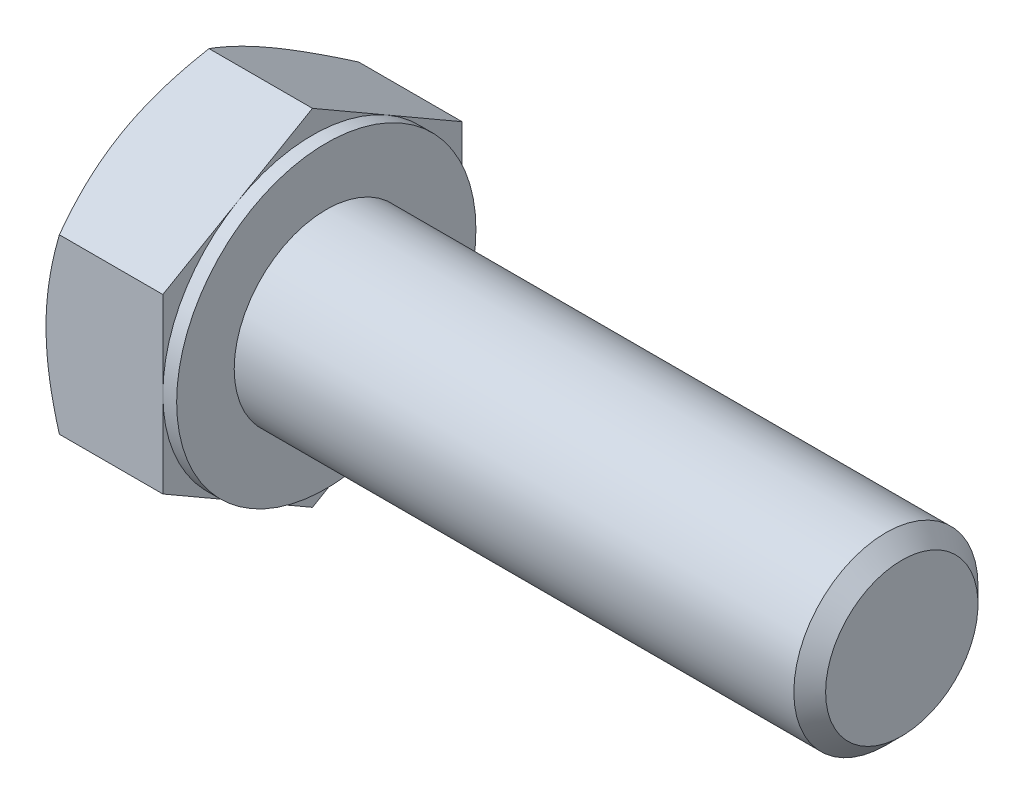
ISO-10303-21;
HEADER;
FILE_DESCRIPTION(('STEP AP214'),'2;1');
FILE_NAME('part.step','',(''),(''),'','','');
FILE_SCHEMA(('AUTOMOTIVE_DESIGN { 1 0 10303 214 1 1 1 1 }'));
ENDSEC;
DATA;
#1=APPLICATION_CONTEXT('core data for automotive mechanical design processes');
#2=APPLICATION_PROTOCOL_DEFINITION('international standard','automotive_design',2000,#1);
#3=PRODUCT_CONTEXT('',#1,'mechanical');
#4=PRODUCT('Part','Part','',(#3));
#5=PRODUCT_RELATED_PRODUCT_CATEGORY('part','',(#4));
#6=PRODUCT_DEFINITION_FORMATION('','',#4);
#7=PRODUCT_DEFINITION_CONTEXT('part definition',#1,'design');
#8=PRODUCT_DEFINITION('design','',#6,#7);
#9=PRODUCT_DEFINITION_SHAPE('','',#8);
#10=(LENGTH_UNIT() NAMED_UNIT(*) SI_UNIT(.MILLI.,.METRE.));
#11=(NAMED_UNIT(*) PLANE_ANGLE_UNIT() SI_UNIT($,.RADIAN.));
#12=(NAMED_UNIT(*) SI_UNIT($,.STERADIAN.) SOLID_ANGLE_UNIT());
#13=UNCERTAINTY_MEASURE_WITH_UNIT(LENGTH_MEASURE(1.E-05),#10,'distance_accuracy_value','');
#14=(GEOMETRIC_REPRESENTATION_CONTEXT(3) GLOBAL_UNCERTAINTY_ASSIGNED_CONTEXT((#13)) GLOBAL_UNIT_ASSIGNED_CONTEXT((#10,
#11,#12)) REPRESENTATION_CONTEXT('',''));
#15=CARTESIAN_POINT('',(0.,0.,0.));
#16=DIRECTION('',(0.,0.,1.));
#17=DIRECTION('',(1.,0.,0.));
#18=AXIS2_PLACEMENT_3D('',#15,#16,#17);
#19=CARTESIAN_POINT('',(5.675,7.50555349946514,0.));
#20=DIRECTION('',(1.,0.,0.));
#21=DIRECTION('',(0.,0.,-1.));
#22=AXIS2_PLACEMENT_3D('',#19,#20,#21);
#23=PLANE('',#22);
#24=CARTESIAN_POINT('',(5.675,0.,0.));
#25=DIRECTION('',(1.,0.,0.));
#26=DIRECTION('',(0.,0.,-1.));
#27=AXIS2_PLACEMENT_3D('',#24,#25,#26);
#28=CIRCLE('',#27,4.);
#29=CARTESIAN_POINT('',(5.675,0.,-4.));
#30=VERTEX_POINT('',#29);
#31=EDGE_CURVE('E270',#30,#30,#28,.F.);
#32=ORIENTED_EDGE('',*,*,#31,.T.);
#33=EDGE_LOOP('',(#32));
#34=FACE_BOUND('',#33,.T.);
#35=CARTESIAN_POINT('',(5.675,0.,0.));
#36=DIRECTION('',(1.,0.,0.));
#37=DIRECTION('',(0.,0.,-1.));
#38=AXIS2_PLACEMENT_3D('',#35,#36,#37);
#39=CIRCLE('',#38,6.5);
#40=CARTESIAN_POINT('',(5.675,0.,-6.5));
#41=VERTEX_POINT('',#40);
#42=EDGE_CURVE('E289',#41,#41,#39,.T.);
#43=ORIENTED_EDGE('',*,*,#42,.T.);
#44=EDGE_LOOP('',(#43));
#45=FACE_BOUND('',#44,.T.);
#46=ADVANCED_FACE('F32',(#34,#45),#23,.T.);
#47=CARTESIAN_POINT('',(0.,0.,0.));
#48=DIRECTION('',(-1.,0.,0.));
#49=DIRECTION('',(0.,0.,1.));
#50=AXIS2_PLACEMENT_3D('',#47,#48,#49);
#51=CYLINDRICAL_SURFACE('',#50,4.);
#52=ORIENTED_EDGE('',*,*,#31,.F.);
#53=EDGE_LOOP('',(#52));
#54=FACE_BOUND('',#53,.T.);
#55=CARTESIAN_POINT('',(29.9845,0.,0.));
#56=DIRECTION('',(-1.,0.,0.));
#57=DIRECTION('',(0.,0.,1.));
#58=AXIS2_PLACEMENT_3D('',#55,#56,#57);
#59=CIRCLE('',#58,4.);
#60=CARTESIAN_POINT('',(29.9845,0.,4.));
#61=VERTEX_POINT('',#60);
#62=EDGE_CURVE('E267',#61,#61,#59,.T.);
#63=ORIENTED_EDGE('',*,*,#62,.T.);
#64=EDGE_LOOP('',(#63));
#65=FACE_BOUND('',#64,.T.);
#66=ADVANCED_FACE('F241',(#54,#65),#51,.T.);
#67=CARTESIAN_POINT('',(30.675,0.,0.));
#68=DIRECTION('',(-1.,0.,0.));
#69=DIRECTION('',(0.,0.,1.));
#70=AXIS2_PLACEMENT_3D('',#67,#68,#69);
#71=CONICAL_SURFACE('',#70,3.3095,0.785398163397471);
#72=ORIENTED_EDGE('',*,*,#62,.F.);
#73=EDGE_LOOP('',(#72));
#74=FACE_BOUND('',#73,.T.);
#75=CARTESIAN_POINT('',(30.675,0.,0.));
#76=DIRECTION('',(-1.,0.,0.));
#77=DIRECTION('',(0.,0.,1.));
#78=AXIS2_PLACEMENT_3D('',#75,#76,#77);
#79=CIRCLE('',#78,3.3095);
#80=CARTESIAN_POINT('',(30.675,0.,3.3095));
#81=VERTEX_POINT('',#80);
#82=EDGE_CURVE('E265',#81,#81,#79,.T.);
#83=ORIENTED_EDGE('',*,*,#82,.T.);
#84=EDGE_LOOP('',(#83));
#85=FACE_BOUND('',#84,.T.);
#86=ADVANCED_FACE('F246',(#74,#85),#71,.T.);
#87=CARTESIAN_POINT('',(30.675,0.,0.));
#88=DIRECTION('',(-1.,0.,0.));
#89=DIRECTION('',(0.,0.,1.));
#90=AXIS2_PLACEMENT_3D('',#87,#88,#89);
#91=PLANE('',#90);
#92=ORIENTED_EDGE('',*,*,#82,.F.);
#93=EDGE_LOOP('',(#92));
#94=FACE_BOUND('',#93,.T.);
#95=ADVANCED_FACE('F253',(#94),#91,.F.);
#96=CARTESIAN_POINT('',(5.075,6.5,0.));
#97=DIRECTION('',(1.,0.,0.));
#98=DIRECTION('',(0.,0.,-1.));
#99=AXIS2_PLACEMENT_3D('',#96,#97,#98);
#100=PLANE('',#99);
#101=DIRECTION('',(0.,0.500000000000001,0.866025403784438));
#102=VECTOR('',#101,1.);
#103=CARTESIAN_POINT('',(5.075,3.75277674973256,-6.5));
#104=LINE('',#103,#102);
#105=CARTESIAN_POINT('',(5.075,3.75277674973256,-6.5));
#106=VERTEX_POINT('',#105);
#107=CARTESIAN_POINT('',(5.075,5.62916512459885,-3.25000000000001));
#108=VERTEX_POINT('',#107);
#109=EDGE_CURVE('E165',#106,#108,#104,.T.);
#110=ORIENTED_EDGE('',*,*,#109,.T.);
#111=CARTESIAN_POINT('',(5.075,0.,0.));
#112=DIRECTION('',(-1.,0.,0.));
#113=DIRECTION('',(0.,0.,1.));
#114=AXIS2_PLACEMENT_3D('',#111,#112,#113);
#115=CIRCLE('',#114,6.5);
#116=CARTESIAN_POINT('',(5.075,0.,-6.5));
#117=VERTEX_POINT('',#116);
#118=EDGE_CURVE('E48',#108,#117,#115,.T.);
#119=ORIENTED_EDGE('',*,*,#118,.T.);
#120=DIRECTION('',(0.,1.,0.));
#121=VECTOR('',#120,1.);
#122=CARTESIAN_POINT('',(5.075,3.75277674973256,-6.5));
#123=LINE('',#122,#121);
#124=EDGE_CURVE('E37',#117,#106,#123,.T.);
#125=ORIENTED_EDGE('',*,*,#124,.T.);
#126=EDGE_LOOP('',(#110,#119,#125));
#127=FACE_BOUND('',#126,.T.);
#128=ADVANCED_FACE('F256',(#127),#100,.T.);
#129=CARTESIAN_POINT('',(5.075,7.50555349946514,0.));
#130=VERTEX_POINT('',#129);
#131=EDGE_CURVE('E163',#108,#130,#104,.T.);
#132=ORIENTED_EDGE('',*,*,#131,.T.);
#133=DIRECTION('',(0.,-0.500000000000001,0.866025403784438));
#134=VECTOR('',#133,1.);
#135=CARTESIAN_POINT('',(5.075,7.50555349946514,0.));
#136=LINE('',#135,#134);
#137=CARTESIAN_POINT('',(5.075,5.62916512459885,3.25));
#138=VERTEX_POINT('',#137);
#139=EDGE_CURVE('E162',#130,#138,#136,.T.);
#140=ORIENTED_EDGE('',*,*,#139,.T.);
#141=EDGE_CURVE('E151',#138,#108,#115,.T.);
#142=ORIENTED_EDGE('',*,*,#141,.T.);
#143=EDGE_LOOP('',(#132,#140,#142));
#144=FACE_BOUND('',#143,.T.);
#145=ADVANCED_FACE('F261',(#144),#100,.T.);
#146=CARTESIAN_POINT('',(5.075,3.75277674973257,6.5));
#147=VERTEX_POINT('',#146);
#148=EDGE_CURVE('E130',#138,#147,#136,.T.);
#149=ORIENTED_EDGE('',*,*,#148,.T.);
#150=DIRECTION('',(0.,-1.,0.));
#151=VECTOR('',#150,1.);
#152=CARTESIAN_POINT('',(5.075,3.75277674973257,6.5));
#153=LINE('',#152,#151);
#154=CARTESIAN_POINT('',(5.075,0.,6.5));
#155=VERTEX_POINT('',#154);
#156=EDGE_CURVE('E124',#147,#155,#153,.T.);
#157=ORIENTED_EDGE('',*,*,#156,.T.);
#158=EDGE_CURVE('E128',#155,#138,#115,.T.);
#159=ORIENTED_EDGE('',*,*,#158,.T.);
#160=EDGE_LOOP('',(#149,#157,#159));
#161=FACE_BOUND('',#160,.T.);
#162=ADVANCED_FACE('F126',(#161),#100,.T.);
#163=CARTESIAN_POINT('',(5.075,-3.75277674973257,6.5));
#164=VERTEX_POINT('',#163);
#165=EDGE_CURVE('E134',#155,#164,#153,.T.);
#166=ORIENTED_EDGE('',*,*,#165,.T.);
#167=DIRECTION('',(0.,-0.500000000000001,-0.866025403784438));
#168=VECTOR('',#167,1.);
#169=CARTESIAN_POINT('',(5.075,-7.50555349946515,0.));
#170=LINE('',#169,#168);
#171=CARTESIAN_POINT('',(5.075,-5.62916512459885,3.25000000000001));
#172=VERTEX_POINT('',#171);
#173=EDGE_CURVE('E141',#164,#172,#170,.T.);
#174=ORIENTED_EDGE('',*,*,#173,.T.);
#175=EDGE_CURVE('E138',#172,#155,#115,.T.);
#176=ORIENTED_EDGE('',*,*,#175,.T.);
#177=EDGE_LOOP('',(#166,#174,#176));
#178=FACE_BOUND('',#177,.T.);
#179=ADVANCED_FACE('F139',(#178),#100,.T.);
#180=CARTESIAN_POINT('',(5.075,-7.50555349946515,0.));
#181=VERTEX_POINT('',#180);
#182=EDGE_CURVE('E157',#172,#181,#170,.T.);
#183=ORIENTED_EDGE('',*,*,#182,.T.);
#184=DIRECTION('',(0.,0.5,-0.866025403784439));
#185=VECTOR('',#184,1.);
#186=CARTESIAN_POINT('',(5.075,-3.75277674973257,-6.5));
#187=LINE('',#186,#185);
#188=CARTESIAN_POINT('',(5.075,-5.62916512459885,-3.25));
#189=VERTEX_POINT('',#188);
#190=EDGE_CURVE('E325',#181,#189,#187,.T.);
#191=ORIENTED_EDGE('',*,*,#190,.T.);
#192=EDGE_CURVE('E145',#189,#172,#115,.T.);
#193=ORIENTED_EDGE('',*,*,#192,.T.);
#194=EDGE_LOOP('',(#183,#191,#193));
#195=FACE_BOUND('',#194,.T.);
#196=ADVANCED_FACE('F330',(#195),#100,.T.);
#197=CARTESIAN_POINT('',(5.075,-3.75277674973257,-6.5));
#198=VERTEX_POINT('',#197);
#199=EDGE_CURVE('E152',#189,#198,#187,.T.);
#200=ORIENTED_EDGE('',*,*,#199,.T.);
#201=EDGE_CURVE('E11',#198,#117,#123,.T.);
#202=ORIENTED_EDGE('',*,*,#201,.T.);
#203=EDGE_CURVE('E343',#117,#189,#115,.T.);
#204=ORIENTED_EDGE('',*,*,#203,.T.);
#205=EDGE_LOOP('',(#200,#202,#204));
#206=FACE_BOUND('',#205,.T.);
#207=ADVANCED_FACE('F262',(#206),#100,.T.);
#208=CARTESIAN_POINT('',(0.,0.,0.));
#209=DIRECTION('',(-1.,0.,0.));
#210=DIRECTION('',(0.,0.,1.));
#211=AXIS2_PLACEMENT_3D('',#208,#209,#210);
#212=CYLINDRICAL_SURFACE('',#211,6.5);
#213=ORIENTED_EDGE('',*,*,#118,.F.);
#214=ORIENTED_EDGE('',*,*,#141,.F.);
#215=ORIENTED_EDGE('',*,*,#158,.F.);
#216=ORIENTED_EDGE('',*,*,#175,.F.);
#217=ORIENTED_EDGE('',*,*,#192,.F.);
#218=ORIENTED_EDGE('',*,*,#203,.F.);
#219=EDGE_LOOP('',(#213,#214,#215,#216,#217,#218));
#220=FACE_BOUND('',#219,.T.);
#221=ORIENTED_EDGE('',*,*,#42,.F.);
#222=EDGE_LOOP('',(#221));
#223=FACE_BOUND('',#222,.T.);
#224=ADVANCED_FACE('F148',(#220,#223),#212,.T.);
#225=CARTESIAN_POINT('',(0.,7.50555349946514,0.));
#226=DIRECTION('',(1.,0.,0.));
#227=DIRECTION('',(0.,0.,-1.));
#228=AXIS2_PLACEMENT_3D('',#225,#226,#227);
#229=PLANE('',#228);
#230=CARTESIAN_POINT('',(0.,0.,0.));
#231=DIRECTION('',(1.,0.,0.));
#232=DIRECTION('',(0.,0.,-1.));
#233=AXIS2_PLACEMENT_3D('',#230,#231,#232);
#234=CIRCLE('',#233,6.5);
#235=CARTESIAN_POINT('',(0.,0.,-6.5));
#236=VERTEX_POINT('',#235);
#237=CARTESIAN_POINT('',(0.,5.62916512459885,-3.25000000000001));
#238=VERTEX_POINT('',#237);
#239=EDGE_CURVE('E288',#236,#238,#234,.T.);
#240=ORIENTED_EDGE('',*,*,#239,.F.);
#241=CARTESIAN_POINT('',(0.,-5.62916512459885,-3.25));
#242=VERTEX_POINT('',#241);
#243=EDGE_CURVE('E285',#242,#236,#234,.T.);
#244=ORIENTED_EDGE('',*,*,#243,.F.);
#245=CARTESIAN_POINT('',(0.,-5.62916512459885,3.25000000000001));
#246=VERTEX_POINT('',#245);
#247=EDGE_CURVE('E287',#246,#242,#234,.T.);
#248=ORIENTED_EDGE('',*,*,#247,.F.);
#249=CARTESIAN_POINT('',(0.,0.,6.5));
#250=VERTEX_POINT('',#249);
#251=EDGE_CURVE('E297',#250,#246,#234,.T.);
#252=ORIENTED_EDGE('',*,*,#251,.F.);
#253=CARTESIAN_POINT('',(0.,0.,0.));
#254=DIRECTION('',(-1.,0.,0.));
#255=DIRECTION('',(0.,0.,1.));
#256=AXIS2_PLACEMENT_3D('',#253,#254,#255);
#257=CIRCLE('',#256,6.5);
#258=CARTESIAN_POINT('',(0.,5.62916512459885,3.25));
#259=VERTEX_POINT('',#258);
#260=EDGE_CURVE('E166',#250,#259,#257,.T.);
#261=ORIENTED_EDGE('',*,*,#260,.T.);
#262=EDGE_CURVE('E292',#238,#259,#234,.T.);
#263=ORIENTED_EDGE('',*,*,#262,.F.);
#264=EDGE_LOOP('',(#240,#244,#248,#252,#261,#263));
#265=FACE_BOUND('',#264,.T.);
#266=ADVANCED_FACE('F195',(#265),#229,.F.);
#267=CARTESIAN_POINT('',(0.,0.,0.));
#268=DIRECTION('',(1.,0.,0.));
#269=DIRECTION('',(0.,0.,-1.));
#270=AXIS2_PLACEMENT_3D('',#267,#268,#269);
#271=CONICAL_SURFACE('',#270,6.5,1.0471975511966);
#272=CARTESIAN_POINT('',(0.580623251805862,3.75266127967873,6.5002));
#273=CARTESIAN_POINT('',(0.53300442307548,3.8351516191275,6.35732254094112));
#274=CARTESIAN_POINT('',(0.487546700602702,3.91794952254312,6.21391236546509));
#275=CARTESIAN_POINT('',(0.401548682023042,4.08421773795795,5.9259273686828));
#276=CARTESIAN_POINT('',(0.361010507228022,4.16768832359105,5.78135207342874));
#277=CARTESIAN_POINT('',(0.247571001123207,4.41943655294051,5.34531134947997));
#278=CARTESIAN_POINT('',(0.183047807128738,4.58870793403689,5.05212471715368));
#279=CARTESIAN_POINT('',(0.107386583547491,4.84201947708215,4.61337625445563));
#280=CARTESIAN_POINT('',(0.0858328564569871,4.92530276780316,4.46912536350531));
#281=CARTESIAN_POINT('',(0.0496903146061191,5.09224566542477,4.17997178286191));
#282=CARTESIAN_POINT('',(0.0351008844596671,5.17590523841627,4.03506915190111));
#283=CARTESIAN_POINT('',(0.0132587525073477,5.34336968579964,3.74501222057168));
#284=CARTESIAN_POINT('',(0.00599772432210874,5.427174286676,3.59985839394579));
#285=CARTESIAN_POINT('',(-0.00103969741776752,5.59485627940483,3.30942466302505));
#286=CARTESIAN_POINT('',(-0.000816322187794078,5.6787336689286,3.16414476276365));
#287=CARTESIAN_POINT('',(0.0100834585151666,5.90853103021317,2.76612405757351));
#288=CARTESIAN_POINT('',(0.0283818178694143,6.05437578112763,2.51351353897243));
#289=CARTESIAN_POINT('',(0.0864063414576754,6.34509659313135,2.00997032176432));
#290=CARTESIAN_POINT('',(0.126152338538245,6.48997163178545,1.75903939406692));
#291=CARTESIAN_POINT('',(0.225505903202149,6.78127752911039,1.25448277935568));
#292=CARTESIAN_POINT('',(0.285534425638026,6.92767163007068,1.00092075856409));
#293=CARTESIAN_POINT('',(0.421774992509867,7.21827667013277,0.497578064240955));
#294=CARTESIAN_POINT('',(0.497955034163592,7.36249133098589,0.247790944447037));
#295=CARTESIAN_POINT('',(0.580623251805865,7.50566896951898,-0.000200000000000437));
#296=B_SPLINE_CURVE_WITH_KNOTS('',3,(#272,#273,#274,#275,#276,#277,#278,#279,#280,#281,#282,
#283,#284,#285,#286,#287,#288,#289,#290,#291,#292,#293,#294,#295),.UNSPECIFIED.,.F.,.F.,(4,2,2,
2,2,2,2,2,2,2,2,4),(0.,0.515105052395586,1.03043143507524,2.06322554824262,2.56697389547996,
3.07067772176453,3.57380860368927,4.07692394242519,4.9527935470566,5.82947446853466,
6.72559912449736,7.61996451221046),.UNSPECIFIED.);
#297=CARTESIAN_POINT('',(0.580556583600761,7.50555349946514,0.));
#298=VERTEX_POINT('',#297);
#299=EDGE_CURVE('E213',#259,#298,#296,.T.);
#300=ORIENTED_EDGE('',*,*,#299,.T.);
#301=CARTESIAN_POINT('',(0.580623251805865,7.50566896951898,0.0002));
#302=CARTESIAN_POINT('',(0.533004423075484,7.4231786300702,-0.14267745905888));
#303=CARTESIAN_POINT('',(0.487546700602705,7.34038072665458,-0.286087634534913));
#304=CARTESIAN_POINT('',(0.401548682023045,7.17411251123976,-0.574072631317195));
#305=CARTESIAN_POINT('',(0.361010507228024,7.09064192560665,-0.718647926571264));
#306=CARTESIAN_POINT('',(0.247571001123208,6.83889369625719,-1.15468865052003));
#307=CARTESIAN_POINT('',(0.18304780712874,6.66962231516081,-1.44787528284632));
#308=CARTESIAN_POINT('',(0.107386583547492,6.41631077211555,-1.88662374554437));
#309=CARTESIAN_POINT('',(0.0858328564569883,6.33302748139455,-2.03087463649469));
#310=CARTESIAN_POINT('',(0.0496903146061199,6.16608458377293,-2.32002821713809));
#311=CARTESIAN_POINT('',(0.0351008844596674,6.08242501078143,-2.46493084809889));
#312=CARTESIAN_POINT('',(0.0132587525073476,5.91496056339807,-2.75498777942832));
#313=CARTESIAN_POINT('',(0.00599772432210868,5.83115596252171,-2.90014160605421));
#314=CARTESIAN_POINT('',(-0.00103969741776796,5.66347396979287,-3.19057533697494));
#315=CARTESIAN_POINT('',(-0.000816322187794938,5.5795965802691,-3.33585523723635));
#316=CARTESIAN_POINT('',(0.010083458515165,5.34979921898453,-3.73387594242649));
#317=CARTESIAN_POINT('',(0.0283818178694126,5.20395446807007,-3.98648646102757));
#318=CARTESIAN_POINT('',(0.0864063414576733,4.91323365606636,-4.49002967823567));
#319=CARTESIAN_POINT('',(0.126152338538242,4.76835861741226,-4.74096060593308));
#320=CARTESIAN_POINT('',(0.225505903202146,4.47705272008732,-5.24551722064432));
#321=CARTESIAN_POINT('',(0.285534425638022,4.33065861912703,-5.49907924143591));
#322=CARTESIAN_POINT('',(0.421774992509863,4.04005357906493,-6.00242193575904));
#323=CARTESIAN_POINT('',(0.497955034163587,3.89583891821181,-6.25220905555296));
#324=CARTESIAN_POINT('',(0.580623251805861,3.75266127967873,-6.5002));
#325=B_SPLINE_CURVE_WITH_KNOTS('',3,(#301,#302,#303,#304,#305,#306,#307,#308,#309,#310,#311,
#312,#313,#314,#315,#316,#317,#318,#319,#320,#321,#322,#323,#324),.UNSPECIFIED.,.F.,.F.,(4,2,2,
2,2,2,2,2,2,2,2,4),(0.,0.515105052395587,1.03043143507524,2.06322554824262,2.56697389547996,
3.07067772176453,3.57380860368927,4.0769239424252,4.9527935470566,5.82947446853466,
6.72559912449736,7.61996451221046),.UNSPECIFIED.);
#326=EDGE_CURVE('E56',#298,#238,#325,.T.);
#327=ORIENTED_EDGE('',*,*,#326,.T.);
#328=ORIENTED_EDGE('',*,*,#262,.T.);
#329=EDGE_LOOP('',(#300,#327,#328));
#330=FACE_BOUND('',#329,.T.);
#331=ADVANCED_FACE('F339',(#330),#271,.T.);
#332=CARTESIAN_POINT('',(3.18835311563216,-10.1137456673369,6.5));
#333=CARTESIAN_POINT('',(3.05034773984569,-9.82952666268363,6.5));
#334=CARTESIAN_POINT('',(2.91365616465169,-9.54465869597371,6.5));
#335=CARTESIAN_POINT('',(2.64363899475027,-8.97327978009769,6.5));
#336=CARTESIAN_POINT('',(2.51031392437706,-8.68676858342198,6.5));
#337=CARTESIAN_POINT('',(2.24710473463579,-8.11029837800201,6.5));
#338=CARTESIAN_POINT('',(2.11724300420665,-7.82032911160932,6.5));
#339=CARTESIAN_POINT('',(1.86279082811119,-7.23809540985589,6.5));
#340=CARTESIAN_POINT('',(1.73820013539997,-6.94583108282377,6.5));
#341=CARTESIAN_POINT('',(1.49176685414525,-6.3490644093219,6.5));
#342=CARTESIAN_POINT('',(1.37014257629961,-6.04447142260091,6.5));
#343=CARTESIAN_POINT('',(1.13601865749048,-5.43173420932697,6.5));
#344=CARTESIAN_POINT('',(1.02352003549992,-5.12358959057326,6.5));
#345=CARTESIAN_POINT('',(0.810575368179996,-4.50382569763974,6.5));
#346=CARTESIAN_POINT('',(0.71010523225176,-4.19221478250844,6.5));
#347=CARTESIAN_POINT('',(0.524420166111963,-3.56452019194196,6.5));
#348=CARTESIAN_POINT('',(0.439200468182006,-3.248437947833,6.5));
#349=CARTESIAN_POINT('',(0.288524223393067,-2.61335465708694,6.5));
#350=CARTESIAN_POINT('',(0.22296186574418,-2.29437912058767,6.5));
#351=CARTESIAN_POINT('',(0.115312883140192,-1.65238219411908,6.5));
#352=CARTESIAN_POINT('',(0.0732239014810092,-1.32936121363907,6.5));
#353=CARTESIAN_POINT('',(0.0304887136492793,-0.845231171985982,6.5));
#354=CARTESIAN_POINT('',(0.0196493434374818,-0.68498220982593,6.5));
#355=CARTESIAN_POINT('',(0.00475298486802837,-0.364162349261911,6.5));
#356=CARTESIAN_POINT('',(0.000695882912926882,-0.203591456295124,6.5));
#357=CARTESIAN_POINT('',(-0.000531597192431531,0.117577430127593,6.5));
#358=CARTESIAN_POINT('',(0.00229809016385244,0.278175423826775,6.5));
#359=CARTESIAN_POINT('',(0.0147726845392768,0.599108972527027,6.5));
#360=CARTESIAN_POINT('',(0.0244179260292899,0.759444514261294,6.5));
#361=CARTESIAN_POINT('',(0.0554961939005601,1.1436994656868,6.5));
#362=CARTESIAN_POINT('',(0.0801030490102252,1.36736763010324,6.5));
#363=CARTESIAN_POINT('',(0.141246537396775,1.81305591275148,6.5));
#364=CARTESIAN_POINT('',(0.177784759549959,2.035075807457,6.5));
#365=CARTESIAN_POINT('',(0.303360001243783,2.69839633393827,6.5));
#366=CARTESIAN_POINT('',(0.408335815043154,3.13672010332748,6.5));
#367=CARTESIAN_POINT('',(0.590564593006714,3.79232112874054,6.5));
#368=CARTESIAN_POINT('',(0.656313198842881,4.01299150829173,6.5));
#369=CARTESIAN_POINT('',(0.794681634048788,4.4521885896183,6.5));
#370=CARTESIAN_POINT('',(0.867301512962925,4.67071527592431,6.5));
#371=CARTESIAN_POINT('',(1.01824353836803,5.10569490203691,6.5));
#372=CARTESIAN_POINT('',(1.09656388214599,5.3221484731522,6.5));
#373=CARTESIAN_POINT('',(1.25798086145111,5.75325725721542,6.5));
#374=CARTESIAN_POINT('',(1.34107741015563,5.96791250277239,6.5));
#375=CARTESIAN_POINT('',(1.56029019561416,6.51888445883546,6.5));
#376=CARTESIAN_POINT('',(1.69936356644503,6.85402316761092,6.5));
#377=CARTESIAN_POINT('',(1.98501958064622,7.52109583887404,6.5));
#378=CARTESIAN_POINT('',(2.13160288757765,7.85302951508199,6.5));
#379=CARTESIAN_POINT('',(2.43059748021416,8.51437865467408,6.5));
#380=CARTESIAN_POINT('',(2.5830105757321,8.84379329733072,6.5));
#381=CARTESIAN_POINT('',(2.89234869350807,9.50047798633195,6.5));
#382=CARTESIAN_POINT('',(3.04927357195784,9.82774810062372,6.5));
#383=CARTESIAN_POINT('',(3.366920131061,10.4809971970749,6.5));
#384=CARTESIAN_POINT('',(3.5276467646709,10.8069737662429,6.5));
#385=CARTESIAN_POINT('',(3.85198555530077,11.4574882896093,6.5));
#386=CARTESIAN_POINT('',(4.01559773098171,11.7820262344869,6.5));
#387=CARTESIAN_POINT('',(4.50986184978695,12.753746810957,6.5));
#388=CARTESIAN_POINT('',(4.84399997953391,13.3991555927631,6.5));
#389=CARTESIAN_POINT('',(5.48575990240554,14.6239779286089,6.5));
#390=CARTESIAN_POINT('',(5.79279643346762,15.20369957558,6.5));
#391=CARTESIAN_POINT('',(6.41069188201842,16.3611382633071,6.5));
#392=CARTESIAN_POINT('',(6.72155098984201,16.9388552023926,6.5));
#393=CARTESIAN_POINT('',(7.34519775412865,18.0910273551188,6.5));
#394=CARTESIAN_POINT('',(7.65797694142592,18.6654871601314,6.5));
#395=CARTESIAN_POINT('',(8.28574397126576,19.8131486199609,6.5));
#396=CARTESIAN_POINT('',(8.60073166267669,20.3863503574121,6.5));
#397=CARTESIAN_POINT('',(8.91652967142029,20.9591024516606,6.5));
#398=B_SPLINE_CURVE_WITH_KNOTS('',3,(#332,#333,#334,#335,#336,#337,#338,#339,#340,#341,#342,
#343,#344,#345,#346,#347,#348,#349,#350,#351,#352,#353,#354,#355,#356,#357,#358,#359,#360,#361,
#362,#363,#364,#365,#366,#367,#368,#369,#370,#371,#372,#373,#374,#375,#376,#377,#378,#379,#380,
#381,#382,#383,#384,#385,#386,#387,#388,#389,#390,#391,#392,#393,#394,#395,#396,#397),
.UNSPECIFIED.,.F.,.F.,(4,2,2,2,2,2,2,2,2,2,2,2,2,2,2,2,2,2,2,2,2,2,2,2,2,2,2,2,2,2,2,2,4),(0.,
0.947868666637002,1.89588406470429,2.8490032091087,3.80207763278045,4.7858977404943,
5.76982755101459,6.75175256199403,7.73337005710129,8.70960474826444,9.68574140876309,
10.1674651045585,10.6491807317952,11.1309009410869,11.612644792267,12.2873175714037,
12.9620802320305,14.3123184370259,15.0030310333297,15.6937486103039,16.3842486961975,
17.074736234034,18.1631508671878,19.2516618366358,20.3405135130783,21.4293305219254,
22.519654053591,23.6099846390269,25.7902468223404,27.7582608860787,29.7263733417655,
31.6886408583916,33.6507753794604),.UNSPECIFIED.);
#399=CARTESIAN_POINT('',(0.580556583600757,3.75277674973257,6.5));
#400=VERTEX_POINT('',#399);
#401=EDGE_CURVE('E225',#250,#400,#398,.T.);
#402=ORIENTED_EDGE('',*,*,#401,.T.);
#403=EDGE_CURVE('E224',#400,#259,#296,.T.);
#404=ORIENTED_EDGE('',*,*,#403,.T.);
#405=ORIENTED_EDGE('',*,*,#260,.F.);
#406=EDGE_LOOP('',(#402,#404,#405));
#407=FACE_BOUND('',#406,.T.);
#408=ADVANCED_FACE('F335',(#407),#271,.T.);
#409=CARTESIAN_POINT('',(0.580556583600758,-3.75277674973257,6.5));
#410=VERTEX_POINT('',#409);
#411=EDGE_CURVE('E268',#410,#250,#398,.T.);
#412=ORIENTED_EDGE('',*,*,#411,.T.);
#413=ORIENTED_EDGE('',*,*,#251,.T.);
#414=CARTESIAN_POINT('',(0.580623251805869,-7.50566896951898,-0.000199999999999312));
#415=CARTESIAN_POINT('',(0.533004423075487,-7.42317863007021,0.142677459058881));
#416=CARTESIAN_POINT('',(0.487546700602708,-7.34038072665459,0.286087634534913));
#417=CARTESIAN_POINT('',(0.401548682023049,-7.17411251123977,0.574072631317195));
#418=CARTESIAN_POINT('',(0.361010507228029,-7.09064192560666,0.718647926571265));
#419=CARTESIAN_POINT('',(0.247571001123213,-6.8388936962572,1.15468865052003));
#420=CARTESIAN_POINT('',(0.183047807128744,-6.66962231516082,1.44787528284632));
#421=CARTESIAN_POINT('',(0.107386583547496,-6.41631077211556,1.88662374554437));
#422=CARTESIAN_POINT('',(0.085832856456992,-6.33302748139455,2.03087463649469));
#423=CARTESIAN_POINT('',(0.0496903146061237,-6.16608458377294,2.32002821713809));
#424=CARTESIAN_POINT('',(0.0351008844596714,-6.08242501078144,2.46493084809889));
#425=CARTESIAN_POINT('',(0.0132587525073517,-5.91496056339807,2.75498777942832));
#426=CARTESIAN_POINT('',(0.00599772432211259,-5.83115596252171,2.90014160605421));
#427=CARTESIAN_POINT('',(-0.00103969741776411,-5.66347396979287,3.19057533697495));
#428=CARTESIAN_POINT('',(-0.00081632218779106,-5.57959658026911,3.33585523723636));
#429=CARTESIAN_POINT('',(0.0100834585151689,-5.34979921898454,3.73387594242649));
#430=CARTESIAN_POINT('',(0.0283818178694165,-5.20395446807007,3.98648646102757));
#431=CARTESIAN_POINT('',(0.0864063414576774,-4.91323365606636,4.49002967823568));
#432=CARTESIAN_POINT('',(0.126152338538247,-4.76835861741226,4.74096060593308));
#433=CARTESIAN_POINT('',(0.22550590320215,-4.47705272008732,5.24551722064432));
#434=CARTESIAN_POINT('',(0.285534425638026,-4.33065861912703,5.49907924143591));
#435=CARTESIAN_POINT('',(0.421774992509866,-4.04005357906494,6.00242193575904));
#436=CARTESIAN_POINT('',(0.497955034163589,-3.89583891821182,6.25220905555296));
#437=CARTESIAN_POINT('',(0.580623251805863,-3.75266127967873,6.5002));
#438=B_SPLINE_CURVE_WITH_KNOTS('',3,(#414,#415,#416,#417,#418,#419,#420,#421,#422,#423,#424,
#425,#426,#427,#428,#429,#430,#431,#432,#433,#434,#435,#436,#437),.UNSPECIFIED.,.F.,.F.,(4,2,2,
2,2,2,2,2,2,2,2,4),(0.,0.515105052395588,1.03043143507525,2.06322554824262,2.56697389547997,
3.07067772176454,3.57380860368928,4.0769239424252,4.9527935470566,5.82947446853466,
6.72559912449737,7.61996451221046),.UNSPECIFIED.);
#439=EDGE_CURVE('E215',#246,#410,#438,.T.);
#440=ORIENTED_EDGE('',*,*,#439,.T.);
#441=EDGE_LOOP('',(#412,#413,#440));
#442=FACE_BOUND('',#441,.T.);
#443=ADVANCED_FACE('F184',(#442),#271,.T.);
#444=CARTESIAN_POINT('',(0.580556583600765,-7.50555349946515,0.));
#445=VERTEX_POINT('',#444);
#446=EDGE_CURVE('E208',#445,#246,#438,.T.);
#447=ORIENTED_EDGE('',*,*,#446,.T.);
#448=ORIENTED_EDGE('',*,*,#247,.T.);
#449=CARTESIAN_POINT('',(0.580623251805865,-3.75266127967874,-6.5002));
#450=CARTESIAN_POINT('',(0.533004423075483,-3.83515161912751,-6.35732254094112));
#451=CARTESIAN_POINT('',(0.487546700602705,-3.91794952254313,-6.21391236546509));
#452=CARTESIAN_POINT('',(0.401548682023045,-4.08421773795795,-5.92592736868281));
#453=CARTESIAN_POINT('',(0.361010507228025,-4.16768832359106,-5.78135207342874));
#454=CARTESIAN_POINT('',(0.247571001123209,-4.41943655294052,-5.34531134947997));
#455=CARTESIAN_POINT('',(0.183047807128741,-4.5887079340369,-5.05212471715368));
#456=CARTESIAN_POINT('',(0.107386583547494,-4.84201947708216,-4.61337625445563));
#457=CARTESIAN_POINT('',(0.0858328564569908,-4.92530276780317,-4.46912536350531));
#458=CARTESIAN_POINT('',(0.0496903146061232,-5.09224566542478,-4.17997178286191));
#459=CARTESIAN_POINT('',(0.0351008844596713,-5.17590523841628,-4.03506915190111));
#460=CARTESIAN_POINT('',(0.0132587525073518,-5.34336968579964,-3.74501222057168));
#461=CARTESIAN_POINT('',(0.00599772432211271,-5.42717428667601,-3.59985839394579));
#462=CARTESIAN_POINT('',(-0.00103969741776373,-5.59485627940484,-3.30942466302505));
#463=CARTESIAN_POINT('',(-0.000816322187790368,-5.67873366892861,-3.16414476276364));
#464=CARTESIAN_POINT('',(0.0100834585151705,-5.90853103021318,-2.76612405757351));
#465=CARTESIAN_POINT('',(0.0283818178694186,-6.05437578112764,-2.51351353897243));
#466=CARTESIAN_POINT('',(0.0864063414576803,-6.34509659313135,-2.00997032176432));
#467=CARTESIAN_POINT('',(0.12615233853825,-6.48997163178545,-1.75903939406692));
#468=CARTESIAN_POINT('',(0.225505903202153,-6.78127752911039,-1.25448277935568));
#469=CARTESIAN_POINT('',(0.28553442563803,-6.92767163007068,-1.00092075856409));
#470=CARTESIAN_POINT('',(0.421774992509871,-7.21827667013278,-0.497578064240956));
#471=CARTESIAN_POINT('',(0.497955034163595,-7.3624913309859,-0.247790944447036));
#472=CARTESIAN_POINT('',(0.580623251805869,-7.50566896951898,0.000199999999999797));
#473=B_SPLINE_CURVE_WITH_KNOTS('',3,(#449,#450,#451,#452,#453,#454,#455,#456,#457,#458,#459,
#460,#461,#462,#463,#464,#465,#466,#467,#468,#469,#470,#471,#472),.UNSPECIFIED.,.F.,.F.,(4,2,2,
2,2,2,2,2,2,2,2,4),(0.,0.515105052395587,1.03043143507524,2.06322554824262,2.56697389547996,
3.07067772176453,3.57380860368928,4.0769239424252,4.9527935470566,5.82947446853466,
6.72559912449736,7.61996451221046),.UNSPECIFIED.);
#474=EDGE_CURVE('E214',#242,#445,#473,.T.);
#475=ORIENTED_EDGE('',*,*,#474,.T.);
#476=EDGE_LOOP('',(#447,#448,#475));
#477=FACE_BOUND('',#476,.T.);
#478=ADVANCED_FACE('F306',(#477),#271,.T.);
#479=CARTESIAN_POINT('',(0.580556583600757,3.75277674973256,-6.5));
#480=VERTEX_POINT('',#479);
#481=EDGE_CURVE('E216',#238,#480,#325,.T.);
#482=ORIENTED_EDGE('',*,*,#481,.T.);
#483=CARTESIAN_POINT('',(3.18835311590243,-10.1137456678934,-6.5));
#484=CARTESIAN_POINT('',(3.05034774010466,-9.82952666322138,-6.5));
#485=CARTESIAN_POINT('',(2.91365616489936,-9.54465869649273,-6.5));
#486=CARTESIAN_POINT('',(2.64363899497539,-8.97327978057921,-6.5));
#487=CARTESIAN_POINT('',(2.51031392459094,-8.68676858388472,-6.5));
#488=CARTESIAN_POINT('',(2.24710473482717,-8.11029837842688,-6.5));
#489=CARTESIAN_POINT('',(2.11724300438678,-7.82032911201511,-6.5));
#490=CARTESIAN_POINT('',(1.86279082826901,-7.23809541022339,-6.5));
#491=CARTESIAN_POINT('',(1.73820013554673,-6.94583108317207,-6.5));
#492=CARTESIAN_POINT('',(1.4917668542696,-6.34906440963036,-6.5));
#493=CARTESIAN_POINT('',(1.37014257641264,-6.04447142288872,-6.5));
#494=CARTESIAN_POINT('',(1.13601865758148,-5.43173420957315,-6.5));
#495=CARTESIAN_POINT('',(1.02352003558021,-5.12358959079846,-6.5));
#496=CARTESIAN_POINT('',(0.810575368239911,-4.50382569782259,-6.5));
#497=CARTESIAN_POINT('',(0.710105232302,-4.19221478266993,-6.5));
#498=CARTESIAN_POINT('',(0.52442016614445,-3.56452019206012,-6.5));
#499=CARTESIAN_POINT('',(0.439200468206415,-3.24843794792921,-6.5));
#500=CARTESIAN_POINT('',(0.288524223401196,-2.61335465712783,-6.5));
#501=CARTESIAN_POINT('',(0.222961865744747,-2.29437912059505,-6.5));
#502=CARTESIAN_POINT('',(0.115312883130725,-1.65238219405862,-6.5));
#503=CARTESIAN_POINT('',(0.0732239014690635,-1.3293612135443,-6.5));
#504=CARTESIAN_POINT('',(0.0304887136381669,-0.845231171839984,-6.5));
#505=CARTESIAN_POINT('',(0.0196493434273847,-0.684982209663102,-6.5));
#506=CARTESIAN_POINT('',(0.00475298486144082,-0.36416234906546,-6.5));
#507=CARTESIAN_POINT('',(0.000695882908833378,-0.203591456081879,-6.5));
#508=CARTESIAN_POINT('',(-0.000531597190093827,0.117577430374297,-6.5));
#509=CARTESIAN_POINT('',(0.00229809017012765,0.278175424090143,-6.5));
#510=CARTESIAN_POINT('',(0.0147726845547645,0.599108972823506,-6.5));
#511=CARTESIAN_POINT('',(0.0244179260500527,0.759444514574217,-6.5));
#512=CARTESIAN_POINT('',(0.0554961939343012,1.14369946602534,-6.5));
#513=CARTESIAN_POINT('',(0.0801030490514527,1.36736763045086,-6.5));
#514=CARTESIAN_POINT('',(0.141246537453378,1.81305591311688,-6.5));
#515=CARTESIAN_POINT('',(0.177784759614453,2.03507580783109,-6.5));
#516=CARTESIAN_POINT('',(0.303360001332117,2.69839633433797,-6.5));
#517=CARTESIAN_POINT('',(0.408335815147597,3.13672010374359,-6.5));
#518=CARTESIAN_POINT('',(0.590564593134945,3.79232112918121,-6.5));
#519=CARTESIAN_POINT('',(0.656313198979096,4.01299150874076,-6.5));
#520=CARTESIAN_POINT('',(0.794681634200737,4.45218859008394,-6.5));
#521=CARTESIAN_POINT('',(0.867301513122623,4.67071527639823,-6.5));
#522=CARTESIAN_POINT('',(1.01824353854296,5.1056949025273,-6.5));
#523=CARTESIAN_POINT('',(1.0965638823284,5.3221484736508,-6.5));
#524=CARTESIAN_POINT('',(1.25798086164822,5.75325725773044,-6.5));
#525=CARTESIAN_POINT('',(1.34107741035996,5.96791250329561,-6.5));
#526=CARTESIAN_POINT('',(1.56029019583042,6.51888445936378,-6.5));
#527=CARTESIAN_POINT('',(1.69936356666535,6.85402316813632,-6.5));
#528=CARTESIAN_POINT('',(1.98501958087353,7.52109583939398,-6.5));
#529=CARTESIAN_POINT('',(2.13160288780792,7.85302951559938,-6.5));
#530=CARTESIAN_POINT('',(2.43059748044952,8.51437865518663,-6.5));
#531=CARTESIAN_POINT('',(2.58301057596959,8.84379329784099,-6.5));
#532=CARTESIAN_POINT('',(2.89234869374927,9.50047798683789,-6.5));
#533=CARTESIAN_POINT('',(3.04927357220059,9.82774810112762,-6.5));
#534=CARTESIAN_POINT('',(3.36692013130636,10.4809971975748,-6.5));
#535=CARTESIAN_POINT('',(3.52764676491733,10.8069737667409,-6.5));
#536=CARTESIAN_POINT('',(3.85198555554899,11.4574882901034,-6.5));
#537=CARTESIAN_POINT('',(4.01559773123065,11.7820262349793,-6.5));
#538=CARTESIAN_POINT('',(4.50986185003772,12.7537468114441,-6.5));
#539=CARTESIAN_POINT('',(4.84399997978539,13.3991555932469,-6.5));
#540=CARTESIAN_POINT('',(5.48575990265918,14.6239779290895,-6.5));
#541=CARTESIAN_POINT('',(5.79279643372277,15.2036995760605,-6.5));
#542=CARTESIAN_POINT('',(6.41069188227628,16.3611382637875,-6.5));
#543=CARTESIAN_POINT('',(6.72155099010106,16.9388552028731,-6.5));
#544=CARTESIAN_POINT('',(7.34519775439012,18.0910273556,-6.5));
#545=CARTESIAN_POINT('',(7.65797694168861,18.6654871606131,-6.5));
#546=CARTESIAN_POINT('',(8.28574397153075,19.8131486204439,-6.5));
#547=CARTESIAN_POINT('',(8.60073166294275,20.3863503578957,-6.5));
#548=CARTESIAN_POINT('',(8.91652967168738,20.9591024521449,-6.49999999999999));
#549=B_SPLINE_CURVE_WITH_KNOTS('',3,(#483,#484,#485,#486,#487,#488,#489,#490,#491,#492,#493,
#494,#495,#496,#497,#498,#499,#500,#501,#502,#503,#504,#505,#506,#507,#508,#509,#510,#511,#512,
#513,#514,#515,#516,#517,#518,#519,#520,#521,#522,#523,#524,#525,#526,#527,#528,#529,#530,#531,
#532,#533,#534,#535,#536,#537,#538,#539,#540,#541,#542,#543,#544,#545,#546,#547,#548),
.UNSPECIFIED.,.F.,.F.,(4,2,2,2,2,2,2,2,2,2,2,2,2,2,2,2,2,2,2,2,2,2,2,2,2,2,2,2,2,2,2,2,4),(0.,
0.947868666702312,1.89588406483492,2.84900320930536,3.80207763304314,4.7858977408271,
5.76982755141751,6.75175256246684,7.73337005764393,8.7096047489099,9.68574140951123,
10.1674651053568,10.6491807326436,11.1309009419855,11.6126447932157,12.287317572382,
12.9620802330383,14.312318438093,15.0030310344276,15.6937486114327,16.3842486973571,
17.0747362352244,18.1631508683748,19.2516618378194,20.3405135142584,21.429330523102,
22.5196540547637,23.6099846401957,25.7902468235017,27.7582608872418,29.7263733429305,
31.6886408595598,33.6507753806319),.UNSPECIFIED.);
#550=EDGE_CURVE('E177',#480,#236,#549,.F.);
#551=ORIENTED_EDGE('',*,*,#550,.T.);
#552=ORIENTED_EDGE('',*,*,#239,.T.);
#553=EDGE_LOOP('',(#482,#551,#552));
#554=FACE_BOUND('',#553,.T.);
#555=ADVANCED_FACE('F320',(#554),#271,.T.);
#556=CARTESIAN_POINT('',(0.580556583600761,-3.75277674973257,-6.5));
#557=VERTEX_POINT('',#556);
#558=EDGE_CURVE('E178',#557,#242,#473,.T.);
#559=ORIENTED_EDGE('',*,*,#558,.T.);
#560=ORIENTED_EDGE('',*,*,#243,.T.);
#561=EDGE_CURVE('E169',#236,#557,#549,.F.);
#562=ORIENTED_EDGE('',*,*,#561,.T.);
#563=EDGE_LOOP('',(#559,#560,#562));
#564=FACE_BOUND('',#563,.T.);
#565=ADVANCED_FACE('F193',(#564),#271,.T.);
#566=CARTESIAN_POINT('',(5.675,3.75277674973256,-6.5));
#567=DIRECTION('',(0.,0.,1.));
#568=DIRECTION('',(0.,-1.,0.));
#569=AXIS2_PLACEMENT_3D('',#566,#567,#568);
#570=PLANE('',#569);
#571=ORIENTED_EDGE('',*,*,#201,.F.);
#572=DIRECTION('',(-1.,0.,0.));
#573=VECTOR('',#572,1.);
#574=CARTESIAN_POINT('',(5.675,-3.75277674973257,-6.5));
#575=LINE('',#574,#573);
#576=EDGE_CURVE('E276',#198,#557,#575,.T.);
#577=ORIENTED_EDGE('',*,*,#576,.T.);
#578=ORIENTED_EDGE('',*,*,#561,.F.);
#579=ORIENTED_EDGE('',*,*,#550,.F.);
#580=DIRECTION('',(-1.,0.,0.));
#581=VECTOR('',#580,1.);
#582=CARTESIAN_POINT('',(5.675,3.75277674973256,-6.5));
#583=LINE('',#582,#581);
#584=EDGE_CURVE('E274',#106,#480,#583,.T.);
#585=ORIENTED_EDGE('',*,*,#584,.F.);
#586=ORIENTED_EDGE('',*,*,#124,.F.);
#587=EDGE_LOOP('',(#571,#577,#578,#579,#585,#586));
#588=FACE_BOUND('',#587,.T.);
#589=ADVANCED_FACE('F188',(#588),#570,.F.);
#590=CARTESIAN_POINT('',(5.675,-3.75277674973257,-6.5));
#591=DIRECTION('',(0.,0.866025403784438,0.5));
#592=DIRECTION('',(0.,-0.5,0.866025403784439));
#593=AXIS2_PLACEMENT_3D('',#590,#591,#592);
#594=PLANE('',#593);
#595=ORIENTED_EDGE('',*,*,#190,.F.);
#596=DIRECTION('',(-1.,0.,0.));
#597=VECTOR('',#596,1.);
#598=CARTESIAN_POINT('',(5.675,-7.50555349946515,0.));
#599=LINE('',#598,#597);
#600=EDGE_CURVE('E278',#181,#445,#599,.T.);
#601=ORIENTED_EDGE('',*,*,#600,.T.);
#602=ORIENTED_EDGE('',*,*,#474,.F.);
#603=ORIENTED_EDGE('',*,*,#558,.F.);
#604=ORIENTED_EDGE('',*,*,#576,.F.);
#605=ORIENTED_EDGE('',*,*,#199,.F.);
#606=EDGE_LOOP('',(#595,#601,#602,#603,#604,#605));
#607=FACE_BOUND('',#606,.T.);
#608=ADVANCED_FACE('F192',(#607),#594,.F.);
#609=CARTESIAN_POINT('',(5.675,-7.50555349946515,0.));
#610=DIRECTION('',(0.,0.866025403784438,-0.500000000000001));
#611=DIRECTION('',(0.,0.500000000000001,0.866025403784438));
#612=AXIS2_PLACEMENT_3D('',#609,#610,#611);
#613=PLANE('',#612);
#614=ORIENTED_EDGE('',*,*,#173,.F.);
#615=DIRECTION('',(-1.,0.,0.));
#616=VECTOR('',#615,1.);
#617=CARTESIAN_POINT('',(5.675,-3.75277674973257,6.5));
#618=LINE('',#617,#616);
#619=EDGE_CURVE('E156',#164,#410,#618,.T.);
#620=ORIENTED_EDGE('',*,*,#619,.T.);
#621=ORIENTED_EDGE('',*,*,#439,.F.);
#622=ORIENTED_EDGE('',*,*,#446,.F.);
#623=ORIENTED_EDGE('',*,*,#600,.F.);
#624=ORIENTED_EDGE('',*,*,#182,.F.);
#625=EDGE_LOOP('',(#614,#620,#621,#622,#623,#624));
#626=FACE_BOUND('',#625,.T.);
#627=ADVANCED_FACE('F200',(#626),#613,.F.);
#628=CARTESIAN_POINT('',(5.675,3.75277674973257,6.5));
#629=DIRECTION('',(0.,0.,-1.));
#630=DIRECTION('',(-1.,0.,0.));
#631=AXIS2_PLACEMENT_3D('',#628,#629,#630);
#632=PLANE('',#631);
#633=ORIENTED_EDGE('',*,*,#156,.F.);
#634=DIRECTION('',(-1.,0.,0.));
#635=VECTOR('',#634,1.);
#636=CARTESIAN_POINT('',(5.675,3.75277674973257,6.5));
#637=LINE('',#636,#635);
#638=EDGE_CURVE('E281',#147,#400,#637,.T.);
#639=ORIENTED_EDGE('',*,*,#638,.T.);
#640=ORIENTED_EDGE('',*,*,#401,.F.);
#641=ORIENTED_EDGE('',*,*,#411,.F.);
#642=ORIENTED_EDGE('',*,*,#619,.F.);
#643=ORIENTED_EDGE('',*,*,#165,.F.);
#644=EDGE_LOOP('',(#633,#639,#640,#641,#642,#643));
#645=FACE_BOUND('',#644,.T.);
#646=ADVANCED_FACE('F154',(#645),#632,.F.);
#647=CARTESIAN_POINT('',(5.675,7.50555349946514,0.));
#648=DIRECTION('',(0.,-0.866025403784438,-0.500000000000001));
#649=DIRECTION('',(0.,0.500000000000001,-0.866025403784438));
#650=AXIS2_PLACEMENT_3D('',#647,#648,#649);
#651=PLANE('',#650);
#652=ORIENTED_EDGE('',*,*,#139,.F.);
#653=DIRECTION('',(-1.,0.,0.));
#654=VECTOR('',#653,1.);
#655=CARTESIAN_POINT('',(5.675,7.50555349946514,0.));
#656=LINE('',#655,#654);
#657=EDGE_CURVE('E283',#130,#298,#656,.T.);
#658=ORIENTED_EDGE('',*,*,#657,.T.);
#659=ORIENTED_EDGE('',*,*,#299,.F.);
#660=ORIENTED_EDGE('',*,*,#403,.F.);
#661=ORIENTED_EDGE('',*,*,#638,.F.);
#662=ORIENTED_EDGE('',*,*,#148,.F.);
#663=EDGE_LOOP('',(#652,#658,#659,#660,#661,#662));
#664=FACE_BOUND('',#663,.T.);
#665=ADVANCED_FACE('F230',(#664),#651,.F.);
#666=CARTESIAN_POINT('',(5.675,3.75277674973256,-6.5));
#667=DIRECTION('',(0.,-0.866025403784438,0.500000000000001));
#668=DIRECTION('',(0.,-0.500000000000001,-0.866025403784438));
#669=AXIS2_PLACEMENT_3D('',#666,#667,#668);
#670=PLANE('',#669);
#671=ORIENTED_EDGE('',*,*,#109,.F.);
#672=ORIENTED_EDGE('',*,*,#584,.T.);
#673=ORIENTED_EDGE('',*,*,#481,.F.);
#674=ORIENTED_EDGE('',*,*,#326,.F.);
#675=ORIENTED_EDGE('',*,*,#657,.F.);
#676=ORIENTED_EDGE('',*,*,#131,.F.);
#677=EDGE_LOOP('',(#671,#672,#673,#674,#675,#676));
#678=FACE_BOUND('',#677,.T.);
#679=ADVANCED_FACE('F34',(#678),#670,.F.);
#680=CLOSED_SHELL('',(#46,#66,#86,#95,#128,#145,#162,#179,#196,#207,#224,#266,#331,#408,#443,
#478,#555,#565,#589,#608,#627,#646,#665,#679));
#681=MANIFOLD_SOLID_BREP('B2',#680);
#682=ADVANCED_BREP_SHAPE_REPRESENTATION('',(#18,#681),#14);
#683=SHAPE_DEFINITION_REPRESENTATION(#9,#682);
ENDSEC;
END-ISO-10303-21;
